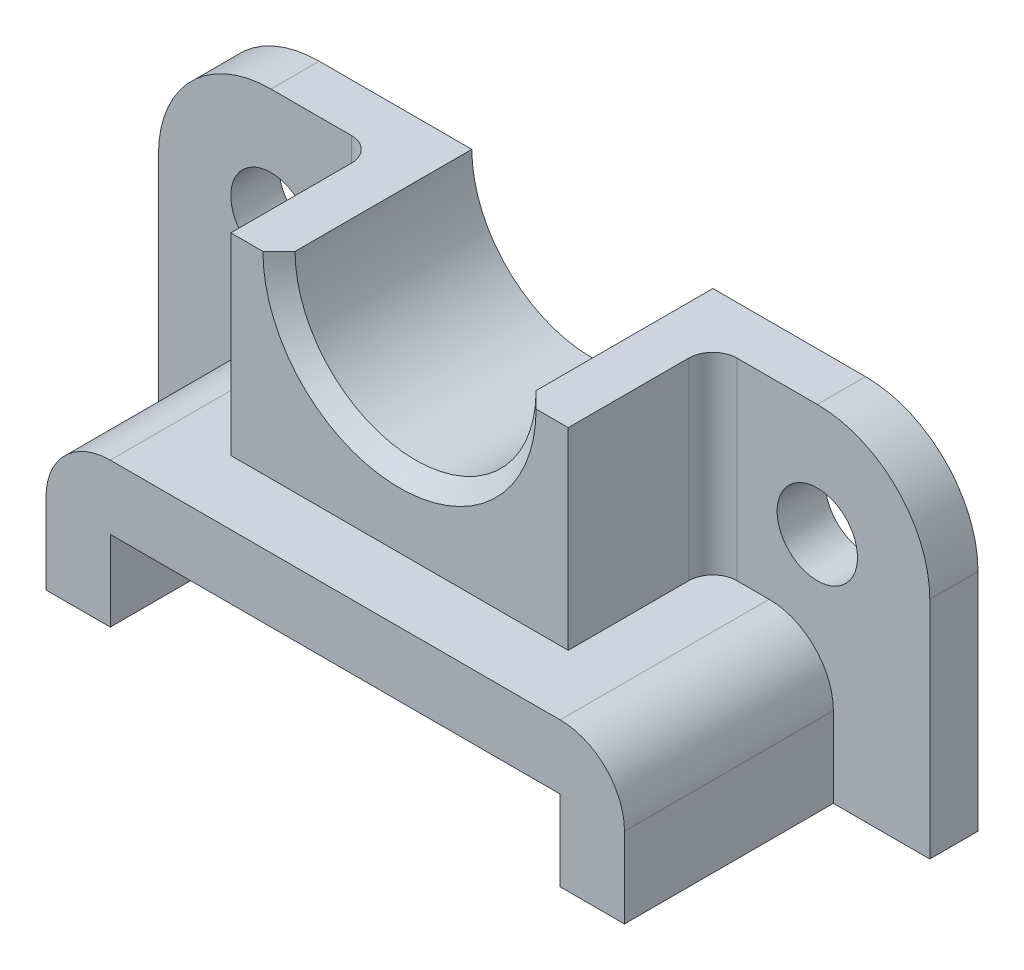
ISO-10303-21;
HEADER;
FILE_DESCRIPTION(('STEP AP214'),'2;1');
FILE_NAME('part.step','',(''),(''),'','','');
FILE_SCHEMA(('AUTOMOTIVE_DESIGN { 1 0 10303 214 1 1 1 1 }'));
ENDSEC;
DATA;
#1=APPLICATION_CONTEXT('core data for automotive mechanical design processes');
#2=APPLICATION_PROTOCOL_DEFINITION('international standard','automotive_design',2000,#1);
#3=PRODUCT_CONTEXT('',#1,'mechanical');
#4=PRODUCT('Part','Part','',(#3));
#5=PRODUCT_RELATED_PRODUCT_CATEGORY('part','',(#4));
#6=PRODUCT_DEFINITION_FORMATION('','',#4);
#7=PRODUCT_DEFINITION_CONTEXT('part definition',#1,'design');
#8=PRODUCT_DEFINITION('design','',#6,#7);
#9=PRODUCT_DEFINITION_SHAPE('','',#8);
#10=(LENGTH_UNIT() NAMED_UNIT(*) SI_UNIT(.MILLI.,.METRE.));
#11=(NAMED_UNIT(*) PLANE_ANGLE_UNIT() SI_UNIT($,.RADIAN.));
#12=(NAMED_UNIT(*) SI_UNIT($,.STERADIAN.) SOLID_ANGLE_UNIT());
#13=UNCERTAINTY_MEASURE_WITH_UNIT(LENGTH_MEASURE(1.E-05),#10,'distance_accuracy_value','');
#14=(GEOMETRIC_REPRESENTATION_CONTEXT(3) GLOBAL_UNCERTAINTY_ASSIGNED_CONTEXT((#13)) GLOBAL_UNIT_ASSIGNED_CONTEXT((#10,
#11,#12)) REPRESENTATION_CONTEXT('',''));
#15=CARTESIAN_POINT('',(0.,0.,0.));
#16=DIRECTION('',(0.,0.,1.));
#17=DIRECTION('',(1.,0.,0.));
#18=AXIS2_PLACEMENT_3D('',#15,#16,#17);
#19=CARTESIAN_POINT('',(0.,0.,19.05));
#20=DIRECTION('',(0.,1.,0.));
#21=DIRECTION('',(0.,0.,1.));
#22=AXIS2_PLACEMENT_3D('',#19,#20,#21);
#23=PLANE('',#22);
#24=DIRECTION('',(0.,0.,1.));
#25=VECTOR('',#24,1.);
#26=CARTESIAN_POINT('',(63.5,0.,69.85));
#27=LINE('',#26,#25);
#28=CARTESIAN_POINT('',(63.5,0.,69.85));
#29=VERTEX_POINT('',#28);
#30=CARTESIAN_POINT('',(63.5,0.,101.6));
#31=VERTEX_POINT('',#30);
#32=EDGE_CURVE('E203',#29,#31,#27,.T.);
#33=ORIENTED_EDGE('',*,*,#32,.T.);
#34=DIRECTION('',(1.,0.,0.));
#35=VECTOR('',#34,1.);
#36=CARTESIAN_POINT('',(38.1,0.,101.6));
#37=LINE('',#36,#35);
#38=CARTESIAN_POINT('',(38.1,0.,101.6));
#39=VERTEX_POINT('',#38);
#40=EDGE_CURVE('E280',#39,#31,#37,.T.);
#41=ORIENTED_EDGE('',*,*,#40,.F.);
#42=DIRECTION('',(0.,0.,-1.));
#43=VECTOR('',#42,1.);
#44=CARTESIAN_POINT('',(38.1,0.,101.6));
#45=LINE('',#44,#43);
#46=CARTESIAN_POINT('',(38.1,0.,19.05));
#47=VERTEX_POINT('',#46);
#48=EDGE_CURVE('E450',#39,#47,#45,.T.);
#49=ORIENTED_EDGE('',*,*,#48,.T.);
#50=DIRECTION('',(1.,0.,0.));
#51=VECTOR('',#50,1.);
#52=CARTESIAN_POINT('',(0.,0.,19.05));
#53=LINE('',#52,#51);
#54=CARTESIAN_POINT('',(0.,0.,19.05));
#55=VERTEX_POINT('',#54);
#56=EDGE_CURVE('E365',#55,#47,#53,.T.);
#57=ORIENTED_EDGE('',*,*,#56,.F.);
#58=DIRECTION('',(0.,0.,-1.));
#59=VECTOR('',#58,1.);
#60=CARTESIAN_POINT('',(0.,0.,19.05));
#61=LINE('',#60,#59);
#62=CARTESIAN_POINT('',(0.,0.,0.));
#63=VERTEX_POINT('',#62);
#64=EDGE_CURVE('E359',#55,#63,#61,.T.);
#65=ORIENTED_EDGE('',*,*,#64,.T.);
#66=DIRECTION('',(1.,0.,0.));
#67=VECTOR('',#66,1.);
#68=CARTESIAN_POINT('',(0.,0.,0.));
#69=LINE('',#68,#67);
#70=CARTESIAN_POINT('',(304.8,0.,0.));
#71=VERTEX_POINT('',#70);
#72=EDGE_CURVE('E350',#63,#71,#69,.T.);
#73=ORIENTED_EDGE('',*,*,#72,.T.);
#74=DIRECTION('',(0.,0.,-1.));
#75=VECTOR('',#74,1.);
#76=CARTESIAN_POINT('',(304.8,0.,19.05));
#77=LINE('',#76,#75);
#78=CARTESIAN_POINT('',(304.8,0.,19.05));
#79=VERTEX_POINT('',#78);
#80=EDGE_CURVE('E362',#79,#71,#77,.T.);
#81=ORIENTED_EDGE('',*,*,#80,.F.);
#82=CARTESIAN_POINT('',(266.7,0.,19.05));
#83=VERTEX_POINT('',#82);
#84=EDGE_CURVE('E368',#83,#79,#53,.T.);
#85=ORIENTED_EDGE('',*,*,#84,.F.);
#86=DIRECTION('',(0.,0.,-1.));
#87=VECTOR('',#86,1.);
#88=CARTESIAN_POINT('',(266.7,0.,101.6));
#89=LINE('',#88,#87);
#90=CARTESIAN_POINT('',(266.7,0.,101.6));
#91=VERTEX_POINT('',#90);
#92=EDGE_CURVE('E283',#91,#83,#89,.T.);
#93=ORIENTED_EDGE('',*,*,#92,.F.);
#94=CARTESIAN_POINT('',(241.3,0.,101.6));
#95=VERTEX_POINT('',#94);
#96=EDGE_CURVE('E279',#95,#91,#37,.T.);
#97=ORIENTED_EDGE('',*,*,#96,.F.);
#98=DIRECTION('',(0.,0.,1.));
#99=VECTOR('',#98,1.);
#100=CARTESIAN_POINT('',(241.3,0.,69.85));
#101=LINE('',#100,#99);
#102=CARTESIAN_POINT('',(241.3,0.,69.85));
#103=VERTEX_POINT('',#102);
#104=EDGE_CURVE('E236',#103,#95,#101,.T.);
#105=ORIENTED_EDGE('',*,*,#104,.F.);
#106=DIRECTION('',(1.,0.,0.));
#107=VECTOR('',#106,1.);
#108=CARTESIAN_POINT('',(63.5,0.,69.85));
#109=LINE('',#108,#107);
#110=EDGE_CURVE('E224',#29,#103,#109,.T.);
#111=ORIENTED_EDGE('',*,*,#110,.F.);
#112=EDGE_LOOP('',(#33,#41,#49,#57,#65,#73,#81,#85,#93,#97,#105,#111));
#113=FACE_BOUND('',#112,.T.);
#114=ADVANCED_FACE('F32',(#113),#23,.F.);
#115=CARTESIAN_POINT('',(38.1,0.,101.6));
#116=DIRECTION('',(0.,0.,-1.));
#117=DIRECTION('',(-1.,0.,0.));
#118=AXIS2_PLACEMENT_3D('',#115,#116,#117);
#119=PLANE('',#118);
#120=DIRECTION('',(0.,-1.,0.));
#121=VECTOR('',#120,1.);
#122=CARTESIAN_POINT('',(266.7,57.15,101.6));
#123=LINE('',#122,#121);
#124=CARTESIAN_POINT('',(266.7,31.75,101.6));
#125=VERTEX_POINT('',#124);
#126=EDGE_CURVE('E277',#125,#91,#123,.T.);
#127=ORIENTED_EDGE('',*,*,#126,.F.);
#128=CARTESIAN_POINT('',(241.3,31.75,101.6));
#129=DIRECTION('',(0.,0.,-1.));
#130=DIRECTION('',(-1.,0.,0.));
#131=AXIS2_PLACEMENT_3D('',#128,#129,#130);
#132=CIRCLE('',#131,25.4);
#133=CARTESIAN_POINT('',(241.3,57.15,101.6));
#134=VERTEX_POINT('',#133);
#135=EDGE_CURVE('E301',#125,#134,#132,.F.);
#136=ORIENTED_EDGE('',*,*,#135,.T.);
#137=DIRECTION('',(-1.,0.,0.));
#138=VECTOR('',#137,1.);
#139=CARTESIAN_POINT('',(266.7,57.15,101.6));
#140=LINE('',#139,#138);
#141=CARTESIAN_POINT('',(63.5,57.15,101.6));
#142=VERTEX_POINT('',#141);
#143=EDGE_CURVE('E273',#134,#142,#140,.T.);
#144=ORIENTED_EDGE('',*,*,#143,.T.);
#145=CARTESIAN_POINT('',(63.5,31.75,101.6));
#146=DIRECTION('',(0.,0.,-1.));
#147=DIRECTION('',(-1.,0.,0.));
#148=AXIS2_PLACEMENT_3D('',#145,#146,#147);
#149=CIRCLE('',#148,25.4);
#150=CARTESIAN_POINT('',(38.1,31.75,101.6));
#151=VERTEX_POINT('',#150);
#152=EDGE_CURVE('E299',#142,#151,#149,.F.);
#153=ORIENTED_EDGE('',*,*,#152,.T.);
#154=DIRECTION('',(0.,1.,0.));
#155=VECTOR('',#154,1.);
#156=CARTESIAN_POINT('',(38.1,0.,101.6));
#157=LINE('',#156,#155);
#158=EDGE_CURVE('E270',#39,#151,#157,.T.);
#159=ORIENTED_EDGE('',*,*,#158,.F.);
#160=ORIENTED_EDGE('',*,*,#40,.T.);
#161=DIRECTION('',(0.,1.,0.));
#162=VECTOR('',#161,1.);
#163=CARTESIAN_POINT('',(63.5,0.,101.6));
#164=LINE('',#163,#162);
#165=CARTESIAN_POINT('',(63.5,31.75,101.6));
#166=VERTEX_POINT('',#165);
#167=EDGE_CURVE('E229',#31,#166,#164,.T.);
#168=ORIENTED_EDGE('',*,*,#167,.T.);
#169=DIRECTION('',(-1.,0.,0.));
#170=VECTOR('',#169,1.);
#171=CARTESIAN_POINT('',(241.3,31.75,101.6));
#172=LINE('',#171,#170);
#173=CARTESIAN_POINT('',(241.3,31.75,101.6));
#174=VERTEX_POINT('',#173);
#175=EDGE_CURVE('E215',#174,#166,#172,.T.);
#176=ORIENTED_EDGE('',*,*,#175,.F.);
#177=DIRECTION('',(0.,-1.,0.));
#178=VECTOR('',#177,1.);
#179=CARTESIAN_POINT('',(241.3,31.75,101.6));
#180=LINE('',#179,#178);
#181=EDGE_CURVE('E209',#174,#95,#180,.T.);
#182=ORIENTED_EDGE('',*,*,#181,.T.);
#183=ORIENTED_EDGE('',*,*,#96,.T.);
#184=EDGE_LOOP('',(#127,#136,#144,#153,#159,#160,#168,#176,#182,#183));
#185=FACE_BOUND('',#184,.T.);
#186=ADVANCED_FACE('F468',(#185),#119,.F.);
#187=CARTESIAN_POINT('',(304.8,133.35,19.05));
#188=DIRECTION('',(0.,-1.,0.));
#189=DIRECTION('',(1.,0.,0.));
#190=AXIS2_PLACEMENT_3D('',#187,#188,#189);
#191=PLANE('',#190);
#192=DIRECTION('',(0.,0.,1.));
#193=VECTOR('',#192,1.);
#194=CARTESIAN_POINT('',(200.025,133.35,0.));
#195=LINE('',#194,#193);
#196=CARTESIAN_POINT('',(200.025,133.35,0.));
#197=VERTEX_POINT('',#196);
#198=CARTESIAN_POINT('',(200.025,133.35,69.85));
#199=VERTEX_POINT('',#198);
#200=EDGE_CURVE('E241',#197,#199,#195,.T.);
#201=ORIENTED_EDGE('',*,*,#200,.T.);
#202=DIRECTION('',(0.70710678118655,0.,0.707106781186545));
#203=VECTOR('',#202,1.);
#204=CARTESIAN_POINT('',(152.4,133.35,22.2250000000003));
#205=LINE('',#204,#203);
#206=CARTESIAN_POINT('',(206.375,133.35,76.2));
#207=VERTEX_POINT('',#206);
#208=EDGE_CURVE('E54',#199,#207,#205,.T.);
#209=ORIENTED_EDGE('',*,*,#208,.T.);
#210=DIRECTION('',(1.,0.,0.));
#211=VECTOR('',#210,1.);
#212=CARTESIAN_POINT('',(85.725,133.35,76.2));
#213=LINE('',#212,#211);
#214=CARTESIAN_POINT('',(219.075,133.35,76.2));
#215=VERTEX_POINT('',#214);
#216=EDGE_CURVE('E254',#207,#215,#213,.T.);
#217=ORIENTED_EDGE('',*,*,#216,.T.);
#218=DIRECTION('',(0.,0.,-1.));
#219=VECTOR('',#218,1.);
#220=CARTESIAN_POINT('',(219.075,133.35,76.2));
#221=LINE('',#220,#219);
#222=CARTESIAN_POINT('',(219.075,133.35,28.575));
#223=VERTEX_POINT('',#222);
#224=EDGE_CURVE('E260',#215,#223,#221,.T.);
#225=ORIENTED_EDGE('',*,*,#224,.T.);
#226=CARTESIAN_POINT('',(228.6,133.35,28.575));
#227=DIRECTION('',(0.,-1.,0.));
#228=DIRECTION('',(1.,0.,0.));
#229=AXIS2_PLACEMENT_3D('',#226,#227,#228);
#230=CIRCLE('',#229,9.525);
#231=CARTESIAN_POINT('',(228.6,133.35,19.05));
#232=VERTEX_POINT('',#231);
#233=EDGE_CURVE('E327',#223,#232,#230,.T.);
#234=ORIENTED_EDGE('',*,*,#233,.T.);
#235=DIRECTION('',(-1.,0.,0.));
#236=VECTOR('',#235,1.);
#237=CARTESIAN_POINT('',(304.8,133.35,19.05));
#238=LINE('',#237,#236);
#239=CARTESIAN_POINT('',(260.35,133.35,19.05));
#240=VERTEX_POINT('',#239);
#241=EDGE_CURVE('E374',#240,#232,#238,.T.);
#242=ORIENTED_EDGE('',*,*,#241,.F.);
#243=DIRECTION('',(0.,0.,-1.));
#244=VECTOR('',#243,1.);
#245=CARTESIAN_POINT('',(260.35,133.35,0.));
#246=LINE('',#245,#244);
#247=CARTESIAN_POINT('',(260.35,133.35,0.));
#248=VERTEX_POINT('',#247);
#249=EDGE_CURVE('E345',#240,#248,#246,.T.);
#250=ORIENTED_EDGE('',*,*,#249,.T.);
#251=DIRECTION('',(-1.,0.,0.));
#252=VECTOR('',#251,1.);
#253=CARTESIAN_POINT('',(304.8,133.35,0.));
#254=LINE('',#253,#252);
#255=EDGE_CURVE('E342',#248,#197,#254,.T.);
#256=ORIENTED_EDGE('',*,*,#255,.T.);
#257=EDGE_LOOP('',(#201,#209,#217,#225,#234,#242,#250,#256));
#258=FACE_BOUND('',#257,.T.);
#259=ADVANCED_FACE('F339',(#258),#191,.F.);
#260=CARTESIAN_POINT('',(0.,0.,19.05));
#261=DIRECTION('',(0.,0.,-1.));
#262=DIRECTION('',(-1.,0.,0.));
#263=AXIS2_PLACEMENT_3D('',#260,#261,#262);
#264=PLANE('',#263);
#265=CARTESIAN_POINT('',(44.45,88.9,19.0499999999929));
#266=DIRECTION('',(0.,0.,1.));
#267=DIRECTION('',(1.,0.,0.));
#268=AXIS2_PLACEMENT_3D('',#265,#266,#267);
#269=CIRCLE('',#268,15.875);
#270=CARTESIAN_POINT('',(60.325,88.9,19.0499999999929));
#271=VERTEX_POINT('',#270);
#272=EDGE_CURVE('E558',#271,#271,#269,.T.);
#273=ORIENTED_EDGE('',*,*,#272,.F.);
#274=EDGE_LOOP('',(#273));
#275=FACE_BOUND('',#274,.T.);
#276=DIRECTION('',(-1.,0.,0.));
#277=VECTOR('',#276,1.);
#278=CARTESIAN_POINT('',(266.7,57.15,19.05));
#279=LINE('',#278,#277);
#280=CARTESIAN_POINT('',(76.2,57.15,19.05));
#281=VERTEX_POINT('',#280);
#282=CARTESIAN_POINT('',(63.5,57.15,19.05));
#283=VERTEX_POINT('',#282);
#284=EDGE_CURVE('E287',#281,#283,#279,.T.);
#285=ORIENTED_EDGE('',*,*,#284,.F.);
#286=DIRECTION('',(0.,-1.,0.));
#287=VECTOR('',#286,1.);
#288=CARTESIAN_POINT('',(76.2,133.35,19.05));
#289=LINE('',#288,#287);
#290=CARTESIAN_POINT('',(76.2,133.35,19.05));
#291=VERTEX_POINT('',#290);
#292=EDGE_CURVE('E318',#281,#291,#289,.F.);
#293=ORIENTED_EDGE('',*,*,#292,.T.);
#294=CARTESIAN_POINT('',(44.4500000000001,133.35,19.05));
#295=VERTEX_POINT('',#294);
#296=EDGE_CURVE('E376',#291,#295,#238,.T.);
#297=ORIENTED_EDGE('',*,*,#296,.T.);
#298=CARTESIAN_POINT('',(44.45,88.9,19.05));
#299=DIRECTION('',(0.,0.,-1.));
#300=DIRECTION('',(-1.,0.,0.));
#301=AXIS2_PLACEMENT_3D('',#298,#299,#300);
#302=CIRCLE('',#301,44.45);
#303=CARTESIAN_POINT('',(0.,88.9,19.05));
#304=VERTEX_POINT('',#303);
#305=EDGE_CURVE('E395',#295,#304,#302,.F.);
#306=ORIENTED_EDGE('',*,*,#305,.T.);
#307=DIRECTION('',(0.,1.,0.));
#308=VECTOR('',#307,1.);
#309=CARTESIAN_POINT('',(0.,0.,19.05));
#310=LINE('',#309,#308);
#311=EDGE_CURVE('E290',#55,#304,#310,.T.);
#312=ORIENTED_EDGE('',*,*,#311,.F.);
#313=ORIENTED_EDGE('',*,*,#56,.T.);
#314=DIRECTION('',(0.,1.,0.));
#315=VECTOR('',#314,1.);
#316=CARTESIAN_POINT('',(38.1,0.,19.05));
#317=LINE('',#316,#315);
#318=CARTESIAN_POINT('',(38.1,31.75,19.05));
#319=VERTEX_POINT('',#318);
#320=EDGE_CURVE('E269',#47,#319,#317,.T.);
#321=ORIENTED_EDGE('',*,*,#320,.T.);
#322=CARTESIAN_POINT('',(63.5,31.75,19.05));
#323=DIRECTION('',(0.,0.,-1.));
#324=DIRECTION('',(-1.,0.,0.));
#325=AXIS2_PLACEMENT_3D('',#322,#323,#324);
#326=CIRCLE('',#325,25.4);
#327=EDGE_CURVE('E308',#319,#283,#326,.T.);
#328=ORIENTED_EDGE('',*,*,#327,.T.);
#329=EDGE_LOOP('',(#285,#293,#297,#306,#312,#313,#321,#328));
#330=FACE_BOUND('',#329,.T.);
#331=ADVANCED_FACE('F444',(#275,#330),#264,.F.);
#332=CARTESIAN_POINT('',(260.35,88.9,19.05));
#333=DIRECTION('',(0.,0.,1.));
#334=DIRECTION('',(1.,0.,0.));
#335=AXIS2_PLACEMENT_3D('',#332,#333,#334);
#336=CIRCLE('',#335,15.875);
#337=CARTESIAN_POINT('',(276.225,88.9,19.05));
#338=VERTEX_POINT('',#337);
#339=EDGE_CURVE('E562',#338,#338,#336,.T.);
#340=ORIENTED_EDGE('',*,*,#339,.F.);
#341=EDGE_LOOP('',(#340));
#342=FACE_BOUND('',#341,.T.);
#343=ORIENTED_EDGE('',*,*,#241,.T.);
#344=DIRECTION('',(0.,1.,0.));
#345=VECTOR('',#344,1.);
#346=CARTESIAN_POINT('',(228.6,57.15,19.05));
#347=LINE('',#346,#345);
#348=CARTESIAN_POINT('',(228.6,57.15,19.05));
#349=VERTEX_POINT('',#348);
#350=EDGE_CURVE('E323',#232,#349,#347,.F.);
#351=ORIENTED_EDGE('',*,*,#350,.T.);
#352=CARTESIAN_POINT('',(241.3,57.15,19.05));
#353=VERTEX_POINT('',#352);
#354=EDGE_CURVE('E284',#353,#349,#279,.T.);
#355=ORIENTED_EDGE('',*,*,#354,.F.);
#356=CARTESIAN_POINT('',(241.3,31.75,19.05));
#357=DIRECTION('',(0.,0.,-1.));
#358=DIRECTION('',(-1.,0.,0.));
#359=AXIS2_PLACEMENT_3D('',#356,#357,#358);
#360=CIRCLE('',#359,25.4);
#361=CARTESIAN_POINT('',(266.7,31.75,19.05));
#362=VERTEX_POINT('',#361);
#363=EDGE_CURVE('E306',#353,#362,#360,.T.);
#364=ORIENTED_EDGE('',*,*,#363,.T.);
#365=DIRECTION('',(0.,-1.,0.));
#366=VECTOR('',#365,1.);
#367=CARTESIAN_POINT('',(266.7,57.15,19.05));
#368=LINE('',#367,#366);
#369=EDGE_CURVE('E274',#362,#83,#368,.T.);
#370=ORIENTED_EDGE('',*,*,#369,.T.);
#371=ORIENTED_EDGE('',*,*,#84,.T.);
#372=DIRECTION('',(0.,-1.,0.));
#373=VECTOR('',#372,1.);
#374=CARTESIAN_POINT('',(304.8,133.35,19.05));
#375=LINE('',#374,#373);
#376=CARTESIAN_POINT('',(304.8,88.9,19.05));
#377=VERTEX_POINT('',#376);
#378=EDGE_CURVE('E372',#377,#79,#375,.T.);
#379=ORIENTED_EDGE('',*,*,#378,.F.);
#380=CARTESIAN_POINT('',(260.35,88.9,19.05));
#381=DIRECTION('',(0.,0.,-1.));
#382=DIRECTION('',(-1.,0.,0.));
#383=AXIS2_PLACEMENT_3D('',#380,#381,#382);
#384=CIRCLE('',#383,44.45);
#385=EDGE_CURVE('E411',#377,#240,#384,.F.);
#386=ORIENTED_EDGE('',*,*,#385,.T.);
#387=EDGE_LOOP('',(#343,#351,#355,#364,#370,#371,#379,#386));
#388=FACE_BOUND('',#387,.T.);
#389=ADVANCED_FACE('F423',(#342,#388),#264,.F.);
#390=CARTESIAN_POINT('',(266.7,57.15,101.6));
#391=DIRECTION('',(0.,-1.,0.));
#392=DIRECTION('',(1.,0.,0.));
#393=AXIS2_PLACEMENT_3D('',#390,#391,#392);
#394=PLANE('',#393);
#395=DIRECTION('',(0.,0.,-1.));
#396=VECTOR('',#395,1.);
#397=CARTESIAN_POINT('',(85.725,57.15,76.2));
#398=LINE('',#397,#396);
#399=CARTESIAN_POINT('',(85.725,57.15,76.2));
#400=VERTEX_POINT('',#399);
#401=CARTESIAN_POINT('',(85.725,57.15,28.575));
#402=VERTEX_POINT('',#401);
#403=EDGE_CURVE('E266',#400,#402,#398,.T.);
#404=ORIENTED_EDGE('',*,*,#403,.T.);
#405=CARTESIAN_POINT('',(76.2,57.15,28.575));
#406=DIRECTION('',(0.,-1.,0.));
#407=DIRECTION('',(1.,0.,0.));
#408=AXIS2_PLACEMENT_3D('',#405,#406,#407);
#409=CIRCLE('',#408,9.525);
#410=EDGE_CURVE('E316',#402,#281,#409,.F.);
#411=ORIENTED_EDGE('',*,*,#410,.T.);
#412=ORIENTED_EDGE('',*,*,#284,.T.);
#413=DIRECTION('',(0.,0.,-1.));
#414=VECTOR('',#413,1.);
#415=CARTESIAN_POINT('',(63.5,57.15,101.6));
#416=LINE('',#415,#414);
#417=EDGE_CURVE('E412',#283,#142,#416,.F.);
#418=ORIENTED_EDGE('',*,*,#417,.T.);
#419=ORIENTED_EDGE('',*,*,#143,.F.);
#420=DIRECTION('',(0.,0.,-1.));
#421=VECTOR('',#420,1.);
#422=CARTESIAN_POINT('',(241.3,57.15,19.05));
#423=LINE('',#422,#421);
#424=EDGE_CURVE('E295',#134,#353,#423,.T.);
#425=ORIENTED_EDGE('',*,*,#424,.T.);
#426=ORIENTED_EDGE('',*,*,#354,.T.);
#427=CARTESIAN_POINT('',(228.6,57.15,28.575));
#428=DIRECTION('',(0.,-1.,0.));
#429=DIRECTION('',(1.,0.,0.));
#430=AXIS2_PLACEMENT_3D('',#427,#428,#429);
#431=CIRCLE('',#430,9.525);
#432=CARTESIAN_POINT('',(219.075,57.15,28.575));
#433=VERTEX_POINT('',#432);
#434=EDGE_CURVE('E314',#349,#433,#431,.F.);
#435=ORIENTED_EDGE('',*,*,#434,.T.);
#436=DIRECTION('',(0.,0.,-1.));
#437=VECTOR('',#436,1.);
#438=CARTESIAN_POINT('',(219.075,57.15,76.2));
#439=LINE('',#438,#437);
#440=CARTESIAN_POINT('',(219.075,57.15,76.2));
#441=VERTEX_POINT('',#440);
#442=EDGE_CURVE('E263',#441,#433,#439,.T.);
#443=ORIENTED_EDGE('',*,*,#442,.F.);
#444=DIRECTION('',(-1.,0.,0.));
#445=VECTOR('',#444,1.);
#446=CARTESIAN_POINT('',(219.075,57.15,76.2));
#447=LINE('',#446,#445);
#448=EDGE_CURVE('E249',#441,#400,#447,.T.);
#449=ORIENTED_EDGE('',*,*,#448,.T.);
#450=EDGE_LOOP('',(#404,#411,#412,#418,#419,#425,#426,#435,#443,#449));
#451=FACE_BOUND('',#450,.T.);
#452=ADVANCED_FACE('F419',(#451),#394,.F.);
#453=CARTESIAN_POINT('',(0.,0.,19.05));
#454=DIRECTION('',(-1.,0.,0.));
#455=DIRECTION('',(0.,0.,1.));
#456=AXIS2_PLACEMENT_3D('',#453,#454,#455);
#457=PLANE('',#456);
#458=ORIENTED_EDGE('',*,*,#311,.T.);
#459=DIRECTION('',(0.,0.,-1.));
#460=VECTOR('',#459,1.);
#461=CARTESIAN_POINT('',(0.,88.9,0.));
#462=LINE('',#461,#460);
#463=CARTESIAN_POINT('',(0.,88.9,0.));
#464=VERTEX_POINT('',#463);
#465=EDGE_CURVE('E361',#304,#464,#462,.T.);
#466=ORIENTED_EDGE('',*,*,#465,.T.);
#467=DIRECTION('',(0.,1.,0.));
#468=VECTOR('',#467,1.);
#469=CARTESIAN_POINT('',(0.,0.,0.));
#470=LINE('',#469,#468);
#471=EDGE_CURVE('E353',#63,#464,#470,.T.);
#472=ORIENTED_EDGE('',*,*,#471,.F.);
#473=ORIENTED_EDGE('',*,*,#64,.F.);
#474=EDGE_LOOP('',(#458,#466,#472,#473));
#475=FACE_BOUND('',#474,.T.);
#476=ADVANCED_FACE('F387',(#475),#457,.T.);
#477=CARTESIAN_POINT('',(304.8,133.35,19.05));
#478=DIRECTION('',(1.,0.,0.));
#479=DIRECTION('',(0.,0.,-1.));
#480=AXIS2_PLACEMENT_3D('',#477,#478,#479);
#481=PLANE('',#480);
#482=DIRECTION('',(0.,-1.,0.));
#483=VECTOR('',#482,1.);
#484=CARTESIAN_POINT('',(304.8,133.35,0.));
#485=LINE('',#484,#483);
#486=CARTESIAN_POINT('',(304.8,88.9,0.));
#487=VERTEX_POINT('',#486);
#488=EDGE_CURVE('E347',#487,#71,#485,.T.);
#489=ORIENTED_EDGE('',*,*,#488,.F.);
#490=DIRECTION('',(0.,0.,-1.));
#491=VECTOR('',#490,1.);
#492=CARTESIAN_POINT('',(304.8,88.9,19.05));
#493=LINE('',#492,#491);
#494=EDGE_CURVE('E409',#487,#377,#493,.F.);
#495=ORIENTED_EDGE('',*,*,#494,.T.);
#496=ORIENTED_EDGE('',*,*,#378,.T.);
#497=ORIENTED_EDGE('',*,*,#80,.T.);
#498=EDGE_LOOP('',(#489,#495,#496,#497));
#499=FACE_BOUND('',#498,.T.);
#500=ADVANCED_FACE('F503',(#499),#481,.T.);
#501=CARTESIAN_POINT('',(85.725,133.35,76.2));
#502=VERTEX_POINT('',#501);
#503=CARTESIAN_POINT('',(98.4249999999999,133.35,76.2));
#504=VERTEX_POINT('',#503);
#505=EDGE_CURVE('E255',#502,#504,#213,.T.);
#506=ORIENTED_EDGE('',*,*,#505,.T.);
#507=DIRECTION('',(0.70710678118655,0.,-0.707106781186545));
#508=VECTOR('',#507,1.);
#509=CARTESIAN_POINT('',(152.4,133.35,22.2250000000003));
#510=LINE('',#509,#508);
#511=CARTESIAN_POINT('',(104.775,133.35,69.85));
#512=VERTEX_POINT('',#511);
#513=EDGE_CURVE('E11',#504,#512,#510,.T.);
#514=ORIENTED_EDGE('',*,*,#513,.T.);
#515=DIRECTION('',(0.,0.,1.));
#516=VECTOR('',#515,1.);
#517=CARTESIAN_POINT('',(104.775,133.35,0.));
#518=LINE('',#517,#516);
#519=CARTESIAN_POINT('',(104.775,133.35,0.));
#520=VERTEX_POINT('',#519);
#521=EDGE_CURVE('E242',#520,#512,#518,.T.);
#522=ORIENTED_EDGE('',*,*,#521,.F.);
#523=CARTESIAN_POINT('',(44.4500000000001,133.35,0.));
#524=VERTEX_POINT('',#523);
#525=EDGE_CURVE('E348',#520,#524,#254,.T.);
#526=ORIENTED_EDGE('',*,*,#525,.T.);
#527=DIRECTION('',(0.,0.,-1.));
#528=VECTOR('',#527,1.);
#529=CARTESIAN_POINT('',(44.45,133.35,19.05));
#530=LINE('',#529,#528);
#531=EDGE_CURVE('E405',#524,#295,#530,.F.);
#532=ORIENTED_EDGE('',*,*,#531,.T.);
#533=ORIENTED_EDGE('',*,*,#296,.F.);
#534=CARTESIAN_POINT('',(76.2,133.35,28.575));
#535=DIRECTION('',(0.,-1.,0.));
#536=DIRECTION('',(1.,0.,0.));
#537=AXIS2_PLACEMENT_3D('',#534,#535,#536);
#538=CIRCLE('',#537,9.525);
#539=CARTESIAN_POINT('',(85.725,133.35,28.575));
#540=VERTEX_POINT('',#539);
#541=EDGE_CURVE('E325',#291,#540,#538,.T.);
#542=ORIENTED_EDGE('',*,*,#541,.T.);
#543=DIRECTION('',(0.,0.,-1.));
#544=VECTOR('',#543,1.);
#545=CARTESIAN_POINT('',(85.725,133.35,76.2));
#546=LINE('',#545,#544);
#547=EDGE_CURVE('E257',#502,#540,#546,.T.);
#548=ORIENTED_EDGE('',*,*,#547,.F.);
#549=EDGE_LOOP('',(#506,#514,#522,#526,#532,#533,#542,#548));
#550=FACE_BOUND('',#549,.T.);
#551=ADVANCED_FACE('F446',(#550),#191,.F.);
#552=CARTESIAN_POINT('',(0.,0.,0.));
#553=DIRECTION('',(0.,0.,-1.));
#554=DIRECTION('',(-1.,0.,0.));
#555=AXIS2_PLACEMENT_3D('',#552,#553,#554);
#556=PLANE('',#555);
#557=CARTESIAN_POINT('',(44.45,88.9,0.));
#558=DIRECTION('',(0.,0.,1.));
#559=DIRECTION('',(1.,0.,0.));
#560=AXIS2_PLACEMENT_3D('',#557,#558,#559);
#561=CIRCLE('',#560,15.875);
#562=CARTESIAN_POINT('',(60.325,88.9,0.));
#563=VERTEX_POINT('',#562);
#564=EDGE_CURVE('E559',#563,#563,#561,.T.);
#565=ORIENTED_EDGE('',*,*,#564,.T.);
#566=EDGE_LOOP('',(#565));
#567=FACE_BOUND('',#566,.T.);
#568=CARTESIAN_POINT('',(260.35,88.9,0.));
#569=DIRECTION('',(0.,0.,1.));
#570=DIRECTION('',(1.,0.,0.));
#571=AXIS2_PLACEMENT_3D('',#568,#569,#570);
#572=CIRCLE('',#571,15.875);
#573=CARTESIAN_POINT('',(276.225,88.9,0.));
#574=VERTEX_POINT('',#573);
#575=EDGE_CURVE('E231',#574,#574,#572,.T.);
#576=ORIENTED_EDGE('',*,*,#575,.T.);
#577=EDGE_LOOP('',(#576));
#578=FACE_BOUND('',#577,.T.);
#579=ORIENTED_EDGE('',*,*,#471,.T.);
#580=CARTESIAN_POINT('',(44.45,88.9,0.));
#581=DIRECTION('',(0.,0.,-1.));
#582=DIRECTION('',(-1.,0.,0.));
#583=AXIS2_PLACEMENT_3D('',#580,#581,#582);
#584=CIRCLE('',#583,44.45);
#585=EDGE_CURVE('E396',#464,#524,#584,.T.);
#586=ORIENTED_EDGE('',*,*,#585,.T.);
#587=ORIENTED_EDGE('',*,*,#525,.F.);
#588=CARTESIAN_POINT('',(152.4,133.35,0.));
#589=DIRECTION('',(0.,0.,1.));
#590=DIRECTION('',(1.,0.,0.));
#591=AXIS2_PLACEMENT_3D('',#588,#589,#590);
#592=CIRCLE('',#591,47.625);
#593=EDGE_CURVE('E217',#520,#197,#592,.T.);
#594=ORIENTED_EDGE('',*,*,#593,.T.);
#595=ORIENTED_EDGE('',*,*,#255,.F.);
#596=CARTESIAN_POINT('',(260.35,88.9,0.));
#597=DIRECTION('',(0.,0.,-1.));
#598=DIRECTION('',(-1.,0.,0.));
#599=AXIS2_PLACEMENT_3D('',#596,#597,#598);
#600=CIRCLE('',#599,44.45);
#601=EDGE_CURVE('E397',#248,#487,#600,.T.);
#602=ORIENTED_EDGE('',*,*,#601,.T.);
#603=ORIENTED_EDGE('',*,*,#488,.T.);
#604=ORIENTED_EDGE('',*,*,#72,.F.);
#605=EDGE_LOOP('',(#579,#586,#587,#594,#595,#602,#603,#604));
#606=FACE_BOUND('',#605,.T.);
#607=ADVANCED_FACE('F448',(#567,#578,#606),#556,.T.);
#608=CARTESIAN_POINT('',(38.1,0.,101.6));
#609=DIRECTION('',(-1.,0.,0.));
#610=DIRECTION('',(0.,0.,1.));
#611=AXIS2_PLACEMENT_3D('',#608,#609,#610);
#612=PLANE('',#611);
#613=ORIENTED_EDGE('',*,*,#158,.T.);
#614=DIRECTION('',(0.,0.,-1.));
#615=VECTOR('',#614,1.);
#616=CARTESIAN_POINT('',(38.1,31.75,19.05));
#617=LINE('',#616,#615);
#618=EDGE_CURVE('E303',#151,#319,#617,.T.);
#619=ORIENTED_EDGE('',*,*,#618,.T.);
#620=ORIENTED_EDGE('',*,*,#320,.F.);
#621=ORIENTED_EDGE('',*,*,#48,.F.);
#622=EDGE_LOOP('',(#613,#619,#620,#621));
#623=FACE_BOUND('',#622,.T.);
#624=ADVANCED_FACE('F470',(#623),#612,.T.);
#625=CARTESIAN_POINT('',(266.7,57.15,101.6));
#626=DIRECTION('',(1.,0.,0.));
#627=DIRECTION('',(0.,0.,-1.));
#628=AXIS2_PLACEMENT_3D('',#625,#626,#627);
#629=PLANE('',#628);
#630=ORIENTED_EDGE('',*,*,#369,.F.);
#631=DIRECTION('',(0.,0.,-1.));
#632=VECTOR('',#631,1.);
#633=CARTESIAN_POINT('',(266.7,31.75,101.6));
#634=LINE('',#633,#632);
#635=EDGE_CURVE('E297',#362,#125,#634,.F.);
#636=ORIENTED_EDGE('',*,*,#635,.T.);
#637=ORIENTED_EDGE('',*,*,#126,.T.);
#638=ORIENTED_EDGE('',*,*,#92,.T.);
#639=EDGE_LOOP('',(#630,#636,#637,#638));
#640=FACE_BOUND('',#639,.T.);
#641=ADVANCED_FACE('F481',(#640),#629,.T.);
#642=CARTESIAN_POINT('',(85.725,133.35,76.2));
#643=DIRECTION('',(1.,0.,0.));
#644=DIRECTION('',(0.,0.,-1.));
#645=AXIS2_PLACEMENT_3D('',#642,#643,#644);
#646=PLANE('',#645);
#647=ORIENTED_EDGE('',*,*,#547,.T.);
#648=DIRECTION('',(0.,-1.,0.));
#649=VECTOR('',#648,1.);
#650=CARTESIAN_POINT('',(85.725,57.15,28.575));
#651=LINE('',#650,#649);
#652=EDGE_CURVE('E311',#540,#402,#651,.T.);
#653=ORIENTED_EDGE('',*,*,#652,.T.);
#654=ORIENTED_EDGE('',*,*,#403,.F.);
#655=DIRECTION('',(0.,-1.,0.));
#656=VECTOR('',#655,1.);
#657=CARTESIAN_POINT('',(85.725,133.35,76.2));
#658=LINE('',#657,#656);
#659=EDGE_CURVE('E245',#502,#400,#658,.T.);
#660=ORIENTED_EDGE('',*,*,#659,.F.);
#661=EDGE_LOOP('',(#647,#653,#654,#660));
#662=FACE_BOUND('',#661,.T.);
#663=ADVANCED_FACE('F438',(#662),#646,.F.);
#664=CARTESIAN_POINT('',(219.075,57.15,76.2));
#665=DIRECTION('',(-1.,0.,0.));
#666=DIRECTION('',(0.,-1.,0.));
#667=AXIS2_PLACEMENT_3D('',#664,#665,#666);
#668=PLANE('',#667);
#669=ORIENTED_EDGE('',*,*,#442,.T.);
#670=DIRECTION('',(0.,1.,0.));
#671=VECTOR('',#670,1.);
#672=CARTESIAN_POINT('',(219.075,133.35,28.575));
#673=LINE('',#672,#671);
#674=EDGE_CURVE('E320',#433,#223,#673,.T.);
#675=ORIENTED_EDGE('',*,*,#674,.T.);
#676=ORIENTED_EDGE('',*,*,#224,.F.);
#677=DIRECTION('',(0.,1.,0.));
#678=VECTOR('',#677,1.);
#679=CARTESIAN_POINT('',(219.075,57.15,76.2));
#680=LINE('',#679,#678);
#681=EDGE_CURVE('E251',#441,#215,#680,.T.);
#682=ORIENTED_EDGE('',*,*,#681,.F.);
#683=EDGE_LOOP('',(#669,#675,#676,#682));
#684=FACE_BOUND('',#683,.T.);
#685=ADVANCED_FACE('F430',(#684),#668,.F.);
#686=CARTESIAN_POINT('',(85.725,57.15,76.2));
#687=DIRECTION('',(0.,0.,-1.));
#688=DIRECTION('',(-1.,0.,0.));
#689=AXIS2_PLACEMENT_3D('',#686,#687,#688);
#690=PLANE('',#689);
#691=ORIENTED_EDGE('',*,*,#216,.F.);
#692=CARTESIAN_POINT('',(152.4,133.35,76.2));
#693=DIRECTION('',(0.,0.,-1.));
#694=DIRECTION('',(-1.,0.,0.));
#695=AXIS2_PLACEMENT_3D('',#692,#693,#694);
#696=CIRCLE('',#695,53.9750000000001);
#697=EDGE_CURVE('E40',#207,#504,#696,.T.);
#698=ORIENTED_EDGE('',*,*,#697,.T.);
#699=ORIENTED_EDGE('',*,*,#505,.F.);
#700=ORIENTED_EDGE('',*,*,#659,.T.);
#701=ORIENTED_EDGE('',*,*,#448,.F.);
#702=ORIENTED_EDGE('',*,*,#681,.T.);
#703=EDGE_LOOP('',(#691,#698,#699,#700,#701,#702));
#704=FACE_BOUND('',#703,.T.);
#705=ADVANCED_FACE('F433',(#704),#690,.F.);
#706=CARTESIAN_POINT('',(152.4,133.35,0.));
#707=DIRECTION('',(0.,0.,1.));
#708=DIRECTION('',(1.,0.,0.));
#709=AXIS2_PLACEMENT_3D('',#706,#707,#708);
#710=CYLINDRICAL_SURFACE('',#709,47.625);
#711=ORIENTED_EDGE('',*,*,#521,.T.);
#712=CARTESIAN_POINT('',(152.4,133.35,69.85));
#713=DIRECTION('',(0.,0.,-1.));
#714=DIRECTION('',(-1.,0.,0.));
#715=AXIS2_PLACEMENT_3D('',#712,#713,#714);
#716=CIRCLE('',#715,47.625);
#717=EDGE_CURVE('E329',#512,#199,#716,.F.);
#718=ORIENTED_EDGE('',*,*,#717,.T.);
#719=ORIENTED_EDGE('',*,*,#200,.F.);
#720=ORIENTED_EDGE('',*,*,#593,.F.);
#721=EDGE_LOOP('',(#711,#718,#719,#720));
#722=FACE_BOUND('',#721,.T.);
#723=ADVANCED_FACE('F335',(#722),#710,.F.);
#724=CARTESIAN_POINT('',(63.5,0.,69.85));
#725=DIRECTION('',(1.,0.,0.));
#726=DIRECTION('',(0.,0.,-1.));
#727=AXIS2_PLACEMENT_3D('',#724,#725,#726);
#728=PLANE('',#727);
#729=ORIENTED_EDGE('',*,*,#167,.F.);
#730=ORIENTED_EDGE('',*,*,#32,.F.);
#731=DIRECTION('',(0.,1.,0.));
#732=VECTOR('',#731,1.);
#733=CARTESIAN_POINT('',(63.5,0.,69.85));
#734=LINE('',#733,#732);
#735=CARTESIAN_POINT('',(63.5,31.75,69.85));
#736=VERTEX_POINT('',#735);
#737=EDGE_CURVE('E197',#29,#736,#734,.T.);
#738=ORIENTED_EDGE('',*,*,#737,.T.);
#739=DIRECTION('',(0.,0.,1.));
#740=VECTOR('',#739,1.);
#741=CARTESIAN_POINT('',(63.5,31.75,69.85));
#742=LINE('',#741,#740);
#743=EDGE_CURVE('E200',#736,#166,#742,.T.);
#744=ORIENTED_EDGE('',*,*,#743,.T.);
#745=EDGE_LOOP('',(#729,#730,#738,#744));
#746=FACE_BOUND('',#745,.T.);
#747=ADVANCED_FACE('F199',(#746),#728,.T.);
#748=CARTESIAN_POINT('',(241.3,31.75,69.85));
#749=DIRECTION('',(0.,1.,0.));
#750=DIRECTION('',(-1.,0.,0.));
#751=AXIS2_PLACEMENT_3D('',#748,#749,#750);
#752=PLANE('',#751);
#753=ORIENTED_EDGE('',*,*,#175,.T.);
#754=ORIENTED_EDGE('',*,*,#743,.F.);
#755=DIRECTION('',(-1.,0.,0.));
#756=VECTOR('',#755,1.);
#757=CARTESIAN_POINT('',(241.3,31.75,69.85));
#758=LINE('',#757,#756);
#759=CARTESIAN_POINT('',(241.3,31.75,69.85));
#760=VERTEX_POINT('',#759);
#761=EDGE_CURVE('E208',#760,#736,#758,.T.);
#762=ORIENTED_EDGE('',*,*,#761,.F.);
#763=DIRECTION('',(0.,0.,1.));
#764=VECTOR('',#763,1.);
#765=CARTESIAN_POINT('',(241.3,31.75,69.85));
#766=LINE('',#765,#764);
#767=EDGE_CURVE('E218',#760,#174,#766,.T.);
#768=ORIENTED_EDGE('',*,*,#767,.T.);
#769=EDGE_LOOP('',(#753,#754,#762,#768));
#770=FACE_BOUND('',#769,.T.);
#771=ADVANCED_FACE('F213',(#770),#752,.F.);
#772=CARTESIAN_POINT('',(241.3,31.75,69.85));
#773=DIRECTION('',(-1.,0.,0.));
#774=DIRECTION('',(0.,0.,1.));
#775=AXIS2_PLACEMENT_3D('',#772,#773,#774);
#776=PLANE('',#775);
#777=ORIENTED_EDGE('',*,*,#181,.F.);
#778=ORIENTED_EDGE('',*,*,#767,.F.);
#779=DIRECTION('',(0.,-1.,0.));
#780=VECTOR('',#779,1.);
#781=CARTESIAN_POINT('',(241.3,31.75,69.85));
#782=LINE('',#781,#780);
#783=EDGE_CURVE('E222',#760,#103,#782,.T.);
#784=ORIENTED_EDGE('',*,*,#783,.T.);
#785=ORIENTED_EDGE('',*,*,#104,.T.);
#786=EDGE_LOOP('',(#777,#778,#784,#785));
#787=FACE_BOUND('',#786,.T.);
#788=ADVANCED_FACE('F529',(#787),#776,.T.);
#789=CARTESIAN_POINT('',(63.5,0.,69.85));
#790=DIRECTION('',(0.,0.,-1.));
#791=DIRECTION('',(-1.,0.,0.));
#792=AXIS2_PLACEMENT_3D('',#789,#790,#791);
#793=PLANE('',#792);
#794=ORIENTED_EDGE('',*,*,#737,.F.);
#795=ORIENTED_EDGE('',*,*,#110,.T.);
#796=ORIENTED_EDGE('',*,*,#783,.F.);
#797=ORIENTED_EDGE('',*,*,#761,.T.);
#798=EDGE_LOOP('',(#794,#795,#796,#797));
#799=FACE_BOUND('',#798,.T.);
#800=ADVANCED_FACE('F221',(#799),#793,.F.);
#801=CARTESIAN_POINT('',(260.35,88.9,0.));
#802=DIRECTION('',(0.,0.,1.));
#803=DIRECTION('',(1.,0.,0.));
#804=AXIS2_PLACEMENT_3D('',#801,#802,#803);
#805=CYLINDRICAL_SURFACE('',#804,15.875);
#806=CARTESIAN_POINT('',(276.225,88.9,0.));
#807=CARTESIAN_POINT('',(276.225,88.9,0.1984375));
#808=CARTESIAN_POINT('',(276.225,88.9,0.396875));
#809=CARTESIAN_POINT('',(276.225,88.9,0.79375));
#810=CARTESIAN_POINT('',(276.225,88.9,0.9921875));
#811=CARTESIAN_POINT('',(276.225,88.9,1.3890625));
#812=CARTESIAN_POINT('',(276.225,88.9,1.5875));
#813=CARTESIAN_POINT('',(276.225,88.9,1.984375));
#814=CARTESIAN_POINT('',(276.225,88.9,2.1828125));
#815=CARTESIAN_POINT('',(276.225,88.9,2.5796875));
#816=CARTESIAN_POINT('',(276.225,88.9,2.778125));
#817=CARTESIAN_POINT('',(276.225,88.9,3.175));
#818=CARTESIAN_POINT('',(276.225,88.9,3.3734375));
#819=CARTESIAN_POINT('',(276.225,88.9,3.7703125));
#820=CARTESIAN_POINT('',(276.225,88.9,3.96875));
#821=CARTESIAN_POINT('',(276.225,88.9,4.365625));
#822=CARTESIAN_POINT('',(276.225,88.9,4.5640625));
#823=CARTESIAN_POINT('',(276.225,88.9,4.9609375));
#824=CARTESIAN_POINT('',(276.225,88.9,5.159375));
#825=CARTESIAN_POINT('',(276.225,88.9,5.55625));
#826=CARTESIAN_POINT('',(276.225,88.9,5.7546875));
#827=CARTESIAN_POINT('',(276.225,88.9,6.1515625));
#828=CARTESIAN_POINT('',(276.225,88.9,6.35));
#829=CARTESIAN_POINT('',(276.225,88.9,6.746875));
#830=CARTESIAN_POINT('',(276.225,88.9,6.9453125));
#831=CARTESIAN_POINT('',(276.225,88.9,7.3421875));
#832=CARTESIAN_POINT('',(276.225,88.9,7.540625));
#833=CARTESIAN_POINT('',(276.225,88.9,7.9375));
#834=CARTESIAN_POINT('',(276.225,88.9,8.1359375));
#835=CARTESIAN_POINT('',(276.225,88.9,8.5328125));
#836=CARTESIAN_POINT('',(276.225,88.9,8.73125));
#837=CARTESIAN_POINT('',(276.225,88.9,9.128125));
#838=CARTESIAN_POINT('',(276.225,88.9,9.3265625));
#839=CARTESIAN_POINT('',(276.225,88.9,9.7234375));
#840=CARTESIAN_POINT('',(276.225,88.9,9.921875));
#841=CARTESIAN_POINT('',(276.225,88.9,10.31875));
#842=CARTESIAN_POINT('',(276.225,88.9,10.5171875));
#843=CARTESIAN_POINT('',(276.225,88.9,10.9140625));
#844=CARTESIAN_POINT('',(276.225,88.9,11.1125));
#845=CARTESIAN_POINT('',(276.225,88.9,11.509375));
#846=CARTESIAN_POINT('',(276.225,88.9,11.7078125));
#847=CARTESIAN_POINT('',(276.225,88.9,12.1046875));
#848=CARTESIAN_POINT('',(276.225,88.9,12.303125));
#849=CARTESIAN_POINT('',(276.225,88.9,12.7));
#850=CARTESIAN_POINT('',(276.225,88.9,12.8984375));
#851=CARTESIAN_POINT('',(276.225,88.9,13.2953125));
#852=CARTESIAN_POINT('',(276.225,88.9,13.49375));
#853=CARTESIAN_POINT('',(276.225,88.9,13.890625));
#854=CARTESIAN_POINT('',(276.225,88.9,14.0890625));
#855=CARTESIAN_POINT('',(276.225,88.9,14.4859375));
#856=CARTESIAN_POINT('',(276.225,88.9,14.684375));
#857=CARTESIAN_POINT('',(276.225,88.9,15.08125));
#858=CARTESIAN_POINT('',(276.225,88.9,15.2796875));
#859=CARTESIAN_POINT('',(276.225,88.9,15.6765625));
#860=CARTESIAN_POINT('',(276.225,88.9,15.875));
#861=CARTESIAN_POINT('',(276.225,88.9,16.271875));
#862=CARTESIAN_POINT('',(276.225,88.9,16.4703125));
#863=CARTESIAN_POINT('',(276.225,88.9,16.8671875));
#864=CARTESIAN_POINT('',(276.225,88.9,17.065625));
#865=CARTESIAN_POINT('',(276.225,88.9,17.4625));
#866=CARTESIAN_POINT('',(276.225,88.9,17.6609375));
#867=CARTESIAN_POINT('',(276.225,88.9,18.0578125));
#868=CARTESIAN_POINT('',(276.225,88.9,18.25625));
#869=CARTESIAN_POINT('',(276.225,88.9,18.653125));
#870=CARTESIAN_POINT('',(276.225,88.9,18.8515625));
#871=CARTESIAN_POINT('',(276.225,88.9,19.05));
#872=B_SPLINE_CURVE_WITH_KNOTS('',3,(#806,#807,#808,#809,#810,#811,#812,#813,#814,#815,#816,
#817,#818,#819,#820,#821,#822,#823,#824,#825,#826,#827,#828,#829,#830,#831,#832,#833,#834,#835,
#836,#837,#838,#839,#840,#841,#842,#843,#844,#845,#846,#847,#848,#849,#850,#851,#852,#853,#854,
#855,#856,#857,#858,#859,#860,#861,#862,#863,#864,#865,#866,#867,#868,#869,#870,#871),
.UNSPECIFIED.,.F.,.F.,(4,2,2,2,2,2,2,2,2,2,2,2,2,2,2,2,2,2,2,2,2,2,2,2,2,2,2,2,2,2,2,2,4),(0.,
0.5953125,1.190625,1.7859375,2.38125,2.9765625,3.571875,4.1671875,4.7625,5.3578125,5.953125,
6.5484375,7.14375,7.7390625,8.334375,8.9296875,9.525,10.1203125,10.715625,11.3109375,11.90625,
12.5015625,13.096875,13.6921875,14.2875,14.8828125,15.478125,16.0734375,16.66875,17.2640625,
17.859375,18.4546875,19.05),.UNSPECIFIED.);
#873=EDGE_CURVE('BSEAM516',#574,#338,#872,.T.);
#874=ORIENTED_EDGE('',*,*,#575,.F.);
#875=ORIENTED_EDGE('',*,*,#339,.T.);
#876=ORIENTED_EDGE('',*,*,#873,.T.);
#877=ORIENTED_EDGE('',*,*,#873,.F.);
#878=EDGE_LOOP('',(#874,#876,#875,#877));
#879=FACE_BOUND('',#878,.T.);
#880=ADVANCED_FACE('F516',(#879),#805,.F.);
#881=CARTESIAN_POINT('',(44.45,88.9,0.));
#882=DIRECTION('',(0.,0.,1.));
#883=DIRECTION('',(1.,0.,0.));
#884=AXIS2_PLACEMENT_3D('',#881,#882,#883);
#885=CYLINDRICAL_SURFACE('',#884,15.875);
#886=ORIENTED_EDGE('',*,*,#564,.F.);
#887=EDGE_LOOP('',(#886));
#888=FACE_BOUND('',#887,.T.);
#889=ORIENTED_EDGE('',*,*,#272,.T.);
#890=EDGE_LOOP('',(#889));
#891=FACE_BOUND('',#890,.T.);
#892=ADVANCED_FACE('F512',(#888,#891),#885,.F.);
#893=CARTESIAN_POINT('',(44.45,88.9,19.05));
#894=DIRECTION('',(0.,0.,1.));
#895=DIRECTION('',(1.,0.,0.));
#896=AXIS2_PLACEMENT_3D('',#893,#894,#895);
#897=CYLINDRICAL_SURFACE('',#896,44.45);
#898=ORIENTED_EDGE('',*,*,#305,.F.);
#899=ORIENTED_EDGE('',*,*,#531,.F.);
#900=ORIENTED_EDGE('',*,*,#585,.F.);
#901=ORIENTED_EDGE('',*,*,#465,.F.);
#902=EDGE_LOOP('',(#898,#899,#900,#901));
#903=FACE_BOUND('',#902,.T.);
#904=ADVANCED_FACE('F393',(#903),#897,.T.);
#905=CARTESIAN_POINT('',(260.35,88.9,19.05));
#906=DIRECTION('',(0.,0.,1.));
#907=DIRECTION('',(1.,0.,0.));
#908=AXIS2_PLACEMENT_3D('',#905,#906,#907);
#909=CYLINDRICAL_SURFACE('',#908,44.45);
#910=ORIENTED_EDGE('',*,*,#385,.F.);
#911=ORIENTED_EDGE('',*,*,#494,.F.);
#912=ORIENTED_EDGE('',*,*,#601,.F.);
#913=ORIENTED_EDGE('',*,*,#249,.F.);
#914=EDGE_LOOP('',(#910,#911,#912,#913));
#915=FACE_BOUND('',#914,.T.);
#916=ADVANCED_FACE('F485',(#915),#909,.T.);
#917=CARTESIAN_POINT('',(241.3,31.75,101.6));
#918=DIRECTION('',(0.,0.,1.));
#919=DIRECTION('',(1.,0.,0.));
#920=AXIS2_PLACEMENT_3D('',#917,#918,#919);
#921=CYLINDRICAL_SURFACE('',#920,25.4);
#922=ORIENTED_EDGE('',*,*,#135,.F.);
#923=ORIENTED_EDGE('',*,*,#635,.F.);
#924=ORIENTED_EDGE('',*,*,#363,.F.);
#925=ORIENTED_EDGE('',*,*,#424,.F.);
#926=EDGE_LOOP('',(#922,#923,#924,#925));
#927=FACE_BOUND('',#926,.T.);
#928=ADVANCED_FACE('F483',(#927),#921,.T.);
#929=CARTESIAN_POINT('',(63.5,31.75,101.6));
#930=DIRECTION('',(0.,0.,1.));
#931=DIRECTION('',(1.,0.,0.));
#932=AXIS2_PLACEMENT_3D('',#929,#930,#931);
#933=CYLINDRICAL_SURFACE('',#932,25.4);
#934=ORIENTED_EDGE('',*,*,#152,.F.);
#935=ORIENTED_EDGE('',*,*,#417,.F.);
#936=ORIENTED_EDGE('',*,*,#327,.F.);
#937=ORIENTED_EDGE('',*,*,#618,.F.);
#938=EDGE_LOOP('',(#934,#935,#936,#937));
#939=FACE_BOUND('',#938,.T.);
#940=ADVANCED_FACE('F464',(#939),#933,.T.);
#941=CARTESIAN_POINT('',(76.2,133.35,28.575));
#942=DIRECTION('',(0.,1.,0.));
#943=DIRECTION('',(0.,0.,1.));
#944=AXIS2_PLACEMENT_3D('',#941,#942,#943);
#945=CYLINDRICAL_SURFACE('',#944,9.525);
#946=ORIENTED_EDGE('',*,*,#541,.F.);
#947=ORIENTED_EDGE('',*,*,#292,.F.);
#948=ORIENTED_EDGE('',*,*,#410,.F.);
#949=ORIENTED_EDGE('',*,*,#652,.F.);
#950=EDGE_LOOP('',(#946,#947,#948,#949));
#951=FACE_BOUND('',#950,.T.);
#952=ADVANCED_FACE('F442',(#951),#945,.F.);
#953=CARTESIAN_POINT('',(228.6,57.15,28.575));
#954=DIRECTION('',(0.,-1.,0.));
#955=DIRECTION('',(1.,0.,0.));
#956=AXIS2_PLACEMENT_3D('',#953,#954,#955);
#957=CYLINDRICAL_SURFACE('',#956,9.525);
#958=ORIENTED_EDGE('',*,*,#434,.F.);
#959=ORIENTED_EDGE('',*,*,#350,.F.);
#960=ORIENTED_EDGE('',*,*,#233,.F.);
#961=ORIENTED_EDGE('',*,*,#674,.F.);
#962=EDGE_LOOP('',(#958,#959,#960,#961));
#963=FACE_BOUND('',#962,.T.);
#964=ADVANCED_FACE('F426',(#963),#957,.F.);
#965=CARTESIAN_POINT('',(152.4,133.35,69.85));
#966=DIRECTION('',(0.,0.,1.));
#967=DIRECTION('',(1.,0.,0.));
#968=AXIS2_PLACEMENT_3D('',#965,#966,#967);
#969=CONICAL_SURFACE('',#968,47.625,0.785398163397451);
#970=ORIENTED_EDGE('',*,*,#513,.F.);
#971=ORIENTED_EDGE('',*,*,#697,.F.);
#972=ORIENTED_EDGE('',*,*,#208,.F.);
#973=ORIENTED_EDGE('',*,*,#717,.F.);
#974=EDGE_LOOP('',(#970,#971,#972,#973));
#975=FACE_BOUND('',#974,.T.);
#976=ADVANCED_FACE('F34',(#975),#969,.F.);
#977=CLOSED_SHELL('',(#114,#186,#259,#331,#389,#452,#476,#500,#551,#607,#624,#641,#663,#685,
#705,#723,#747,#771,#788,#800,#880,#892,#904,#916,#928,#940,#952,#964,#976));
#978=MANIFOLD_SOLID_BREP('B2',#977);
#979=ADVANCED_BREP_SHAPE_REPRESENTATION('',(#18,#978),#14);
#980=SHAPE_DEFINITION_REPRESENTATION(#9,#979);
ENDSEC;
END-ISO-10303-21;
